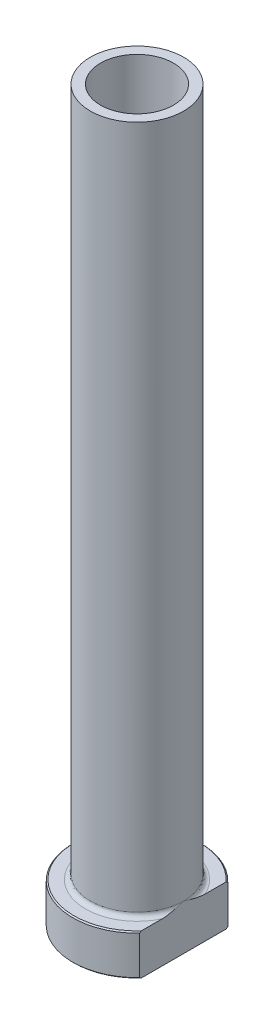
ISO-10303-21;
HEADER;
FILE_DESCRIPTION(('STEP AP214'),'2;1');
FILE_NAME('part.step','',(''),(''),'','','');
FILE_SCHEMA(('AUTOMOTIVE_DESIGN { 1 0 10303 214 1 1 1 1 }'));
ENDSEC;
DATA;
#1=APPLICATION_CONTEXT('core data for automotive mechanical design processes');
#2=APPLICATION_PROTOCOL_DEFINITION('international standard','automotive_design',2000,#1);
#3=PRODUCT_CONTEXT('',#1,'mechanical');
#4=PRODUCT('Part','Part','',(#3));
#5=PRODUCT_RELATED_PRODUCT_CATEGORY('part','',(#4));
#6=PRODUCT_DEFINITION_FORMATION('','',#4);
#7=PRODUCT_DEFINITION_CONTEXT('part definition',#1,'design');
#8=PRODUCT_DEFINITION('design','',#6,#7);
#9=PRODUCT_DEFINITION_SHAPE('','',#8);
#10=(LENGTH_UNIT() NAMED_UNIT(*) SI_UNIT(.MILLI.,.METRE.));
#11=(NAMED_UNIT(*) PLANE_ANGLE_UNIT() SI_UNIT($,.RADIAN.));
#12=(NAMED_UNIT(*) SI_UNIT($,.STERADIAN.) SOLID_ANGLE_UNIT());
#13=UNCERTAINTY_MEASURE_WITH_UNIT(LENGTH_MEASURE(1.E-05),#10,'distance_accuracy_value','');
#14=(GEOMETRIC_REPRESENTATION_CONTEXT(3) GLOBAL_UNCERTAINTY_ASSIGNED_CONTEXT((#13)) GLOBAL_UNIT_ASSIGNED_CONTEXT((#10,
#11,#12)) REPRESENTATION_CONTEXT('',''));
#15=CARTESIAN_POINT('',(0.,0.,0.));
#16=DIRECTION('',(0.,0.,1.));
#17=DIRECTION('',(1.,0.,0.));
#18=AXIS2_PLACEMENT_3D('',#15,#16,#17);
#19=CARTESIAN_POINT('',(0.,92.1876809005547,0.));
#20=DIRECTION('',(0.,1.,0.));
#21=DIRECTION('',(0.,0.,1.));
#22=AXIS2_PLACEMENT_3D('',#19,#20,#21);
#23=CYLINDRICAL_SURFACE('',#22,6.24999999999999);
#24=CARTESIAN_POINT('',(0.,125.,0.));
#25=DIRECTION('',(0.,1.,0.));
#26=DIRECTION('',(0.,0.,1.));
#27=AXIS2_PLACEMENT_3D('',#24,#25,#26);
#28=CIRCLE('',#27,6.24999999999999);
#29=CARTESIAN_POINT('',(0.,125.,6.24999999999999));
#30=VERTEX_POINT('',#29);
#31=EDGE_CURVE('E167',#30,#30,#28,.T.);
#32=ORIENTED_EDGE('',*,*,#31,.T.);
#33=EDGE_LOOP('',(#32));
#34=FACE_BOUND('',#33,.T.);
#35=CARTESIAN_POINT('',(0.,70.,0.));
#36=DIRECTION('',(0.,1.,0.));
#37=DIRECTION('',(0.,0.,1.));
#38=AXIS2_PLACEMENT_3D('',#35,#36,#37);
#39=CIRCLE('',#38,6.24999999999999);
#40=CARTESIAN_POINT('',(0.,70.,6.24999999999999));
#41=VERTEX_POINT('',#40);
#42=EDGE_CURVE('E170',#41,#41,#39,.T.);
#43=ORIENTED_EDGE('',*,*,#42,.F.);
#44=EDGE_LOOP('',(#43));
#45=FACE_BOUND('',#44,.T.);
#46=ADVANCED_FACE('F32',(#34,#45),#23,.F.);
#47=CARTESIAN_POINT('',(-6.24999999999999,125.,0.));
#48=DIRECTION('',(0.,1.,0.));
#49=DIRECTION('',(0.,0.,1.));
#50=AXIS2_PLACEMENT_3D('',#47,#48,#49);
#51=PLANE('',#50);
#52=CARTESIAN_POINT('',(0.,125.,0.));
#53=DIRECTION('',(0.,1.,0.));
#54=DIRECTION('',(0.,0.,1.));
#55=AXIS2_PLACEMENT_3D('',#52,#53,#54);
#56=CIRCLE('',#55,8.);
#57=CARTESIAN_POINT('',(0.,125.,8.));
#58=VERTEX_POINT('',#57);
#59=EDGE_CURVE('E174',#58,#58,#56,.T.);
#60=ORIENTED_EDGE('',*,*,#59,.T.);
#61=EDGE_LOOP('',(#60));
#62=FACE_BOUND('',#61,.T.);
#63=ORIENTED_EDGE('',*,*,#31,.F.);
#64=EDGE_LOOP('',(#63));
#65=FACE_BOUND('',#64,.T.);
#66=ADVANCED_FACE('F157',(#62,#65),#51,.T.);
#67=CARTESIAN_POINT('',(0.,92.1876809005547,0.));
#68=DIRECTION('',(0.,1.,0.));
#69=DIRECTION('',(0.,0.,1.));
#70=AXIS2_PLACEMENT_3D('',#67,#68,#69);
#71=CYLINDRICAL_SURFACE('',#70,8.);
#72=CARTESIAN_POINT('',(0.,7.8,0.));
#73=DIRECTION('',(0.,1.,0.));
#74=DIRECTION('',(0.,0.,1.));
#75=AXIS2_PLACEMENT_3D('',#72,#73,#74);
#76=CIRCLE('',#75,8.);
#77=CARTESIAN_POINT('',(8.,7.8,0.));
#78=VERTEX_POINT('',#77);
#79=EDGE_CURVE('E180',#78,#78,#76,.T.);
#80=ORIENTED_EDGE('',*,*,#79,.T.);
#81=EDGE_LOOP('',(#80));
#82=FACE_BOUND('',#81,.T.);
#83=ORIENTED_EDGE('',*,*,#59,.F.);
#84=EDGE_LOOP('',(#83));
#85=FACE_BOUND('',#84,.T.);
#86=ADVANCED_FACE('F162',(#82,#85),#71,.T.);
#87=CARTESIAN_POINT('',(-7.99999999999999,7.,0.));
#88=DIRECTION('',(0.,1.,0.));
#89=DIRECTION('',(0.,0.,1.));
#90=AXIS2_PLACEMENT_3D('',#87,#88,#89);
#91=PLANE('',#90);
#92=DIRECTION('',(0.,0.,1.));
#93=VECTOR('',#92,1.);
#94=CARTESIAN_POINT('',(8.,7.,0.));
#95=LINE('',#94,#93);
#96=CARTESIAN_POINT('',(8.,7.,-7.25534285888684));
#97=VERTEX_POINT('',#96);
#98=CARTESIAN_POINT('',(8.,7.,-3.66606055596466));
#99=VERTEX_POINT('',#98);
#100=EDGE_CURVE('E54',#97,#99,#95,.T.);
#101=ORIENTED_EDGE('',*,*,#100,.F.);
#102=CARTESIAN_POINT('',(0.,7.,0.));
#103=DIRECTION('',(0.,1.,0.));
#104=DIRECTION('',(0.,0.,1.));
#105=AXIS2_PLACEMENT_3D('',#102,#103,#104);
#106=CIRCLE('',#105,10.8);
#107=CARTESIAN_POINT('',(8.,7.,7.25534285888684));
#108=VERTEX_POINT('',#107);
#109=EDGE_CURVE('E186',#97,#108,#106,.T.);
#110=ORIENTED_EDGE('',*,*,#109,.T.);
#111=CARTESIAN_POINT('',(8.,7.,3.66606055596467));
#112=VERTEX_POINT('',#111);
#113=EDGE_CURVE('E134',#112,#108,#95,.T.);
#114=ORIENTED_EDGE('',*,*,#113,.F.);
#115=CARTESIAN_POINT('',(0.,7.,0.));
#116=DIRECTION('',(0.,1.,0.));
#117=DIRECTION('',(0.,0.,1.));
#118=AXIS2_PLACEMENT_3D('',#115,#116,#117);
#119=CIRCLE('',#118,8.8);
#120=EDGE_CURVE('E183',#112,#99,#119,.F.);
#121=ORIENTED_EDGE('',*,*,#120,.T.);
#122=EDGE_LOOP('',(#101,#110,#114,#121));
#123=FACE_BOUND('',#122,.T.);
#124=ADVANCED_FACE('F197',(#123),#91,.T.);
#125=CARTESIAN_POINT('',(0.,92.1876809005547,0.));
#126=DIRECTION('',(0.,1.,0.));
#127=DIRECTION('',(0.,0.,1.));
#128=AXIS2_PLACEMENT_3D('',#125,#126,#127);
#129=CYLINDRICAL_SURFACE('',#128,11.);
#130=DIRECTION('',(0.,-1.,0.));
#131=VECTOR('',#130,1.);
#132=CARTESIAN_POINT('',(8.,125.,7.54983443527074));
#133=LINE('',#132,#131);
#134=CARTESIAN_POINT('',(8.,6.80000000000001,7.54983443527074));
#135=VERTEX_POINT('',#134);
#136=CARTESIAN_POINT('',(8.,0.200000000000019,7.54983443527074));
#137=VERTEX_POINT('',#136);
#138=EDGE_CURVE('E82',#135,#137,#133,.T.);
#139=ORIENTED_EDGE('',*,*,#138,.F.);
#140=CARTESIAN_POINT('',(0.,6.80000000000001,0.));
#141=DIRECTION('',(0.,1.,0.));
#142=DIRECTION('',(0.,0.,1.));
#143=AXIS2_PLACEMENT_3D('',#140,#141,#142);
#144=CIRCLE('',#143,11.);
#145=CARTESIAN_POINT('',(8.,6.80000000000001,-7.54983443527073));
#146=VERTEX_POINT('',#145);
#147=EDGE_CURVE('E95',#135,#146,#144,.F.);
#148=ORIENTED_EDGE('',*,*,#147,.T.);
#149=DIRECTION('',(0.,-1.,0.));
#150=VECTOR('',#149,1.);
#151=CARTESIAN_POINT('',(8.,125.,-7.54983443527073));
#152=LINE('',#151,#150);
#153=CARTESIAN_POINT('',(8.,0.20000000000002,-7.54983443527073));
#154=VERTEX_POINT('',#153);
#155=EDGE_CURVE('E192',#146,#154,#152,.T.);
#156=ORIENTED_EDGE('',*,*,#155,.T.);
#157=CARTESIAN_POINT('',(0.,0.20000000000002,0.));
#158=DIRECTION('',(0.,-1.,0.));
#159=DIRECTION('',(0.,0.,-1.));
#160=AXIS2_PLACEMENT_3D('',#157,#158,#159);
#161=CIRCLE('',#160,11.);
#162=EDGE_CURVE('E98',#154,#137,#161,.F.);
#163=ORIENTED_EDGE('',*,*,#162,.T.);
#164=EDGE_LOOP('',(#139,#148,#156,#163));
#165=FACE_BOUND('',#164,.T.);
#166=ADVANCED_FACE('F190',(#165),#129,.T.);
#167=CARTESIAN_POINT('',(-11.,0.,0.));
#168=DIRECTION('',(0.,-1.,0.));
#169=DIRECTION('',(0.,0.,-1.));
#170=AXIS2_PLACEMENT_3D('',#167,#168,#169);
#171=PLANE('',#170);
#172=CARTESIAN_POINT('',(0.,0.,0.));
#173=DIRECTION('',(0.,-1.,0.));
#174=DIRECTION('',(0.,0.,-1.));
#175=AXIS2_PLACEMENT_3D('',#172,#173,#174);
#176=CIRCLE('',#175,6.99999999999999);
#177=CARTESIAN_POINT('',(0.,0.,-6.99999999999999));
#178=VERTEX_POINT('',#177);
#179=EDGE_CURVE('E40',#178,#178,#176,.F.);
#180=ORIENTED_EDGE('',*,*,#179,.T.);
#181=EDGE_LOOP('',(#180));
#182=FACE_BOUND('',#181,.T.);
#183=DIRECTION('',(0.,0.,-1.));
#184=VECTOR('',#183,1.);
#185=CARTESIAN_POINT('',(8.,0.,7.54983443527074));
#186=LINE('',#185,#184);
#187=CARTESIAN_POINT('',(8.,0.,7.25534285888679));
#188=VERTEX_POINT('',#187);
#189=CARTESIAN_POINT('',(8.,0.,-7.25534285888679));
#190=VERTEX_POINT('',#189);
#191=EDGE_CURVE('E47',#188,#190,#186,.T.);
#192=ORIENTED_EDGE('',*,*,#191,.F.);
#193=CARTESIAN_POINT('',(0.,0.,0.));
#194=DIRECTION('',(0.,-1.,0.));
#195=DIRECTION('',(0.,0.,-1.));
#196=AXIS2_PLACEMENT_3D('',#193,#194,#195);
#197=CIRCLE('',#196,10.8);
#198=EDGE_CURVE('E92',#188,#190,#197,.T.);
#199=ORIENTED_EDGE('',*,*,#198,.T.);
#200=EDGE_LOOP('',(#192,#199));
#201=FACE_BOUND('',#200,.T.);
#202=ADVANCED_FACE('F91',(#182,#201),#171,.T.);
#203=CARTESIAN_POINT('',(0.,92.1876809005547,0.));
#204=DIRECTION('',(0.,1.,0.));
#205=DIRECTION('',(0.,0.,1.));
#206=AXIS2_PLACEMENT_3D('',#203,#204,#205);
#207=CYLINDRICAL_SURFACE('',#206,6.49999999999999);
#208=CARTESIAN_POINT('',(0.,0.5,0.));
#209=DIRECTION('',(0.,-1.,0.));
#210=DIRECTION('',(0.,0.,-1.));
#211=AXIS2_PLACEMENT_3D('',#208,#209,#210);
#212=CIRCLE('',#211,6.49999999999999);
#213=CARTESIAN_POINT('',(0.,0.5,-6.49999999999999));
#214=VERTEX_POINT('',#213);
#215=EDGE_CURVE('E11',#214,#214,#212,.T.);
#216=ORIENTED_EDGE('',*,*,#215,.T.);
#217=EDGE_LOOP('',(#216));
#218=FACE_BOUND('',#217,.T.);
#219=CARTESIAN_POINT('',(0.,58.,0.));
#220=DIRECTION('',(0.,1.,0.));
#221=DIRECTION('',(0.,0.,1.));
#222=AXIS2_PLACEMENT_3D('',#219,#220,#221);
#223=CIRCLE('',#222,6.5);
#224=CARTESIAN_POINT('',(0.,58.,6.5));
#225=VERTEX_POINT('',#224);
#226=EDGE_CURVE('E172',#225,#225,#223,.T.);
#227=ORIENTED_EDGE('',*,*,#226,.T.);
#228=EDGE_LOOP('',(#227));
#229=FACE_BOUND('',#228,.T.);
#230=ADVANCED_FACE('F215',(#218,#229),#207,.F.);
#231=CARTESIAN_POINT('',(0.,58.,0.));
#232=DIRECTION('',(0.,-1.,0.));
#233=DIRECTION('',(0.,0.,-1.));
#234=AXIS2_PLACEMENT_3D('',#231,#232,#233);
#235=CONICAL_SURFACE('',#234,6.5,0.0208303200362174);
#236=ORIENTED_EDGE('',*,*,#42,.T.);
#237=EDGE_LOOP('',(#236));
#238=FACE_BOUND('',#237,.T.);
#239=ORIENTED_EDGE('',*,*,#226,.F.);
#240=EDGE_LOOP('',(#239));
#241=FACE_BOUND('',#240,.T.);
#242=ADVANCED_FACE('F111',(#238,#241),#235,.F.);
#243=CARTESIAN_POINT('',(0.,7.8,0.));
#244=DIRECTION('',(0.,1.,0.));
#245=DIRECTION('',(0.,0.,1.));
#246=AXIS2_PLACEMENT_3D('',#243,#244,#245);
#247=TOROIDAL_SURFACE('',#246,8.8,0.8);
#248=ORIENTED_EDGE('',*,*,#120,.F.);
#249=CARTESIAN_POINT('',(8.,7.8,0.));
#250=CARTESIAN_POINT('',(8.,7.80000101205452,-1.0962450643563E-10));
#251=CARTESIAN_POINT('',(8.,7.80000202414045,2.93324062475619E-07));
#252=CARTESIAN_POINT('',(8.,7.80000394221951,1.16283082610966E-06));
#253=CARTESIAN_POINT('',(8.,7.80000483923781,1.75365125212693E-06));
#254=CARTESIAN_POINT('',(8.,7.80000665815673,3.16446761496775E-06));
#255=CARTESIAN_POINT('',(8.,7.80000756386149,4.0054914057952E-06));
#256=CARTESIAN_POINT('',(8.,7.80000923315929,5.7834789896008E-06));
#257=CARTESIAN_POINT('',(8.,7.80000999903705,6.71842007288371E-06));
#258=CARTESIAN_POINT('',(8.,7.80001270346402,1.02037212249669E-05));
#259=CARTESIAN_POINT('',(8.,7.80001449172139,1.28740396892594E-05));
#260=CARTESIAN_POINT('',(8.,7.80001755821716,1.82727380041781E-05));
#261=CARTESIAN_POINT('',(8.,7.8000188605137,2.0988155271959E-05));
#262=CARTESIAN_POINT('',(8.,7.80002405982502,3.20647795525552E-05));
#263=CARTESIAN_POINT('',(8.,7.80002777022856,4.05225573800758E-05));
#264=CARTESIAN_POINT('',(8.,7.80003348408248,5.68037688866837E-05));
#265=CARTESIAN_POINT('',(8.,7.80003564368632,6.45728858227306E-05));
#266=CARTESIAN_POINT('',(8.,7.8000509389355,0.000121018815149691));
#267=CARTESIAN_POINT('',(8.,7.80006211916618,0.000170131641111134));
#268=CARTESIAN_POINT('',(7.99999999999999,7.80011100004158,0.000362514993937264));
#269=CARTESIAN_POINT('',(8.,7.80015802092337,0.000503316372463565));
#270=CARTESIAN_POINT('',(8.00000000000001,7.80033939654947,0.00105711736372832));
#271=CARTESIAN_POINT('',(8.,7.80046737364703,0.0014716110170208));
#272=CARTESIAN_POINT('',(7.99999999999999,7.80097644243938,0.00310648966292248));
#273=CARTESIAN_POINT('',(7.99999999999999,7.80136531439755,0.00432501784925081));
#274=CARTESIAN_POINT('',(8.00000000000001,7.80297358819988,0.00937955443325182));
#275=CARTESIAN_POINT('',(8.,7.80418342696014,0.01321784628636));
#276=CARTESIAN_POINT('',(7.99999999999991,7.82754122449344,0.0873020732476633));
#277=CARTESIAN_POINT('',(7.99999999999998,7.84979021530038,0.157524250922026));
#278=CARTESIAN_POINT('',(8.00000000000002,7.89322681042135,0.295235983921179));
#279=CARTESIAN_POINT('',(8.,7.91442151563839,0.362723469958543));
#280=CARTESIAN_POINT('',(7.99999999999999,7.95923432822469,0.506178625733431));
#281=CARTESIAN_POINT('',(8.,7.9828252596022,0.582154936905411));
#282=CARTESIAN_POINT('',(8.,8.02983069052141,0.735069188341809));
#283=CARTESIAN_POINT('',(8.,8.05324046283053,0.812008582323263));
#284=CARTESIAN_POINT('',(8.,8.09303795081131,0.944645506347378));
#285=CARTESIAN_POINT('',(8.,8.10956807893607,1.00030022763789));
#286=CARTESIAN_POINT('',(8.,8.14221289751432,1.11157683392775));
#287=CARTESIAN_POINT('',(8.,8.15832854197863,1.16719843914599));
#288=CARTESIAN_POINT('',(8.,8.20527739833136,1.3316405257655));
#289=CARTESIAN_POINT('',(8.,8.23549814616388,1.4406371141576));
#290=CARTESIAN_POINT('',(8.,8.29826335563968,1.6760683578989));
#291=CARTESIAN_POINT('',(8.,8.33044741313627,1.80259995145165));
#292=CARTESIAN_POINT('',(8.,8.39126396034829,2.05750030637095));
#293=CARTESIAN_POINT('',(8.,8.41986879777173,2.18587573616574));
#294=CARTESIAN_POINT('',(8.,8.47414203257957,2.45321874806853));
#295=CARTESIAN_POINT('',(8.,8.49943375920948,2.59226394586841));
#296=CARTESIAN_POINT('',(8.,8.54278750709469,2.87150561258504));
#297=CARTESIAN_POINT('',(8.,8.5608502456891,3.01170196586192));
#298=CARTESIAN_POINT('',(8.,8.58291287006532,3.24319459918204));
#299=CARTESIAN_POINT('',(8.,8.589627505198,3.33423069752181));
#300=CARTESIAN_POINT('',(8.,8.59844042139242,3.51651109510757));
#301=CARTESIAN_POINT('',(8.,8.60054027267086,3.60775531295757));
#302=CARTESIAN_POINT('',(8.,8.59923478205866,3.78855451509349));
#303=CARTESIAN_POINT('',(8.,8.59592927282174,3.87810991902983));
#304=CARTESIAN_POINT('',(8.,8.5828878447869,4.05671727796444));
#305=CARTESIAN_POINT('',(8.,8.57315718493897,4.14576958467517));
#306=CARTESIAN_POINT('',(8.,8.54786053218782,4.3091004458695));
#307=CARTESIAN_POINT('',(8.,8.53341905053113,4.38354919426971));
#308=CARTESIAN_POINT('',(8.,8.49747543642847,4.53120906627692));
#309=CARTESIAN_POINT('',(8.,8.47593618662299,4.60441150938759));
#310=CARTESIAN_POINT('',(8.,8.42376924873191,4.74853436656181));
#311=CARTESIAN_POINT('',(8.,8.39303920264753,4.81941853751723));
#312=CARTESIAN_POINT('',(8.,8.32008168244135,4.95490582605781));
#313=CARTESIAN_POINT('',(8.,8.27792970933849,5.0195465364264));
#314=CARTESIAN_POINT('',(8.,8.20692535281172,5.10354772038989));
#315=CARTESIAN_POINT('',(8.,8.18397837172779,5.12788591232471));
#316=CARTESIAN_POINT('',(8.,8.13503511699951,5.17336988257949));
#317=CARTESIAN_POINT('',(8.,8.10903727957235,5.19451401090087));
#318=CARTESIAN_POINT('',(8.,8.05362521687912,5.23266411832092));
#319=CARTESIAN_POINT('',(8.,8.02417247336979,5.24961527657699));
#320=CARTESIAN_POINT('',(8.,7.96255238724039,5.27751973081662));
#321=CARTESIAN_POINT('',(8.,7.93039220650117,5.28848831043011));
#322=CARTESIAN_POINT('',(8.,7.87282733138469,5.30129051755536));
#323=CARTESIAN_POINT('',(8.,7.84777777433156,5.30473535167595));
#324=CARTESIAN_POINT('',(8.,7.79745799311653,5.30730687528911));
#325=CARTESIAN_POINT('',(8.,7.77218785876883,5.30643524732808));
#326=CARTESIAN_POINT('',(8.,7.72220872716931,5.30045124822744));
#327=CARTESIAN_POINT('',(8.,7.69749884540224,5.29534612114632));
#328=CARTESIAN_POINT('',(8.,7.64919855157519,5.2813062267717));
#329=CARTESIAN_POINT('',(8.,7.62560888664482,5.27236894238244));
#330=CARTESIAN_POINT('',(8.,7.57186978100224,5.24749103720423));
#331=CARTESIAN_POINT('',(8.,7.54235117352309,5.23019143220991));
#332=CARTESIAN_POINT('',(8.,7.48647501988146,5.1910787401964));
#333=CARTESIAN_POINT('',(8.,7.46012476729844,5.16925554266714));
#334=CARTESIAN_POINT('',(8.,7.39758131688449,5.11005232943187));
#335=CARTESIAN_POINT('',(8.,7.36345256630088,5.07050732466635));
#336=CARTESIAN_POINT('',(8.,7.30158414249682,4.98680536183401));
#337=CARTESIAN_POINT('',(8.,7.27385227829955,4.94264286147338));
#338=CARTESIAN_POINT('',(8.,7.22655631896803,4.85651446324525));
#339=CARTESIAN_POINT('',(8.,7.20642608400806,4.81485346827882));
#340=CARTESIAN_POINT('',(8.,7.16979237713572,4.7299501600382));
#341=CARTESIAN_POINT('',(8.,7.15329194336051,4.68670655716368));
#342=CARTESIAN_POINT('',(8.,7.1082475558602,4.55471342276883));
#343=CARTESIAN_POINT('',(8.,7.0844820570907,4.46433285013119));
#344=CARTESIAN_POINT('',(8.,7.04606817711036,4.27884520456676));
#345=CARTESIAN_POINT('',(8.,7.03172934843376,4.18367881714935));
#346=CARTESIAN_POINT('',(8.,7.01115182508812,3.99231790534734));
#347=CARTESIAN_POINT('',(8.,7.00492963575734,3.89612168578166));
#348=CARTESIAN_POINT('',(8.,6.99917472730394,3.70683203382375));
#349=CARTESIAN_POINT('',(8.,6.99942213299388,3.6137441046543));
#350=CARTESIAN_POINT('',(8.,7.0050033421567,3.42814181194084));
#351=CARTESIAN_POINT('',(8.,7.0103150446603,3.33562671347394));
#352=CARTESIAN_POINT('',(8.,7.02729273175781,3.12465235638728));
#353=CARTESIAN_POINT('',(8.,7.04033732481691,3.00630616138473));
#354=CARTESIAN_POINT('',(8.,7.0720601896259,2.77043320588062));
#355=CARTESIAN_POINT('',(8.,7.09073668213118,2.65290619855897));
#356=CARTESIAN_POINT('',(8.,7.13314336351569,2.41598317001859));
#357=CARTESIAN_POINT('',(8.,7.15698005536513,2.29660645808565));
#358=CARTESIAN_POINT('',(8.,7.20856500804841,2.05839418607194));
#359=CARTESIAN_POINT('',(8.,7.23632304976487,1.93956077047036));
#360=CARTESIAN_POINT('',(8.,7.30538420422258,1.66026758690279));
#361=CARTESIAN_POINT('',(8.,7.34797978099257,1.50012949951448));
#362=CARTESIAN_POINT('',(8.,7.43661699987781,1.18271330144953));
#363=CARTESIAN_POINT('',(8.,7.48261587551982,1.02542306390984));
#364=CARTESIAN_POINT('',(8.,7.55073856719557,0.798945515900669));
#365=CARTESIAN_POINT('',(8.,7.57189590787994,0.729464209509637));
#366=CARTESIAN_POINT('',(8.,7.61466169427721,0.590318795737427));
#367=CARTESIAN_POINT('',(8.,7.63627166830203,0.520655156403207));
#368=CARTESIAN_POINT('',(8.,7.68075896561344,0.378072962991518));
#369=CARTESIAN_POINT('',(8.,7.70364749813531,0.305157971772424));
#370=CARTESIAN_POINT('',(8.,7.74926260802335,0.160522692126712));
#371=CARTESIAN_POINT('',(8.,7.77198614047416,0.0888015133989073));
#372=CARTESIAN_POINT('',(8.,7.79581756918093,0.0132146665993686));
#373=CARTESIAN_POINT('',(8.,7.79702841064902,0.00937319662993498));
#374=CARTESIAN_POINT('',(8.,7.79863692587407,0.00431792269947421));
#375=CARTESIAN_POINT('',(8.,7.79902501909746,0.00310183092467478));
#376=CARTESIAN_POINT('',(8.,7.79953313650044,0.00147000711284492));
#377=CARTESIAN_POINT('',(8.,7.79966092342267,0.00105612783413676));
#378=CARTESIAN_POINT('',(8.,7.79984206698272,0.000503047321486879));
#379=CARTESIAN_POINT('',(8.,7.79988905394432,0.000362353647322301));
#380=CARTESIAN_POINT('',(8.,7.79993790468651,0.000170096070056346));
#381=CARTESIAN_POINT('',(8.,7.79994908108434,0.000120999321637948));
#382=CARTESIAN_POINT('',(8.,7.79996436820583,6.45695787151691E-05));
#383=CARTESIAN_POINT('',(8.,7.79996652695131,5.68014455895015E-05));
#384=CARTESIAN_POINT('',(8.,7.79997223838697,4.05221683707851E-05));
#385=CARTESIAN_POINT('',(8.,7.79997594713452,3.20652909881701E-05));
#386=CARTESIAN_POINT('',(8.,7.7999811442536,2.09895693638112E-05));
#387=CARTESIAN_POINT('',(8.,7.79998244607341,1.8274225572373E-05));
#388=CARTESIAN_POINT('',(8.,7.79998551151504,1.28755880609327E-05));
#389=CARTESIAN_POINT('',(8.,7.79998729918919,1.02052494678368E-05));
#390=CARTESIAN_POINT('',(8.,7.79999000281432,6.71981830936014E-06));
#391=CARTESIAN_POINT('',(8.,7.79999076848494,5.78481760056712E-06));
#392=CARTESIAN_POINT('',(8.,7.79999243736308,4.00667344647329E-06));
#393=CARTESIAN_POINT('',(8.,7.79999334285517,3.16555188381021E-06));
#394=CARTESIAN_POINT('',(8.,7.79999516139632,1.75450207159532E-06));
#395=CARTESIAN_POINT('',(8.,7.79999605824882,1.16355293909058E-06));
#396=CARTESIAN_POINT('',(8.,7.799997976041,2.93728150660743E-07));
#397=CARTESIAN_POINT('',(8.,7.79999898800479,1.0962175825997E-10));
#398=CARTESIAN_POINT('',(8.,7.8,0.));
#399=B_SPLINE_CURVE_WITH_KNOTS('',3,(#249,#250,#251,#252,#253,#254,#255,#256,#257,#258,#259,
#260,#261,#262,#263,#264,#265,#266,#267,#268,#269,#270,#271,#272,#273,#274,#275,#276,#277,#278,
#279,#280,#281,#282,#283,#284,#285,#286,#287,#288,#289,#290,#291,#292,#293,#294,#295,#296,#297,
#298,#299,#300,#301,#302,#303,#304,#305,#306,#307,#308,#309,#310,#311,#312,#313,#314,#315,#316,
#317,#318,#319,#320,#321,#322,#323,#324,#325,#326,#327,#328,#329,#330,#331,#332,#333,#334,#335,
#336,#337,#338,#339,#340,#341,#342,#343,#344,#345,#346,#347,#348,#349,#350,#351,#352,#353,#354,
#355,#356,#357,#358,#359,#360,#361,#362,#363,#364,#365,#366,#367,#368,#369,#370,#371,#372,#373,
#374,#375,#376,#377,#378,#379,#380,#381,#382,#383,#384,#385,#386,#387,#388,#389,#390,#391,#392,
#393,#394,#395,#396,#397,#398),.UNSPECIFIED.,.T.,.F.,(4,2,2,2,2,2,2,2,2,2,2,2,2,2,2,2,2,2,2,2,2,
2,2,2,2,2,2,2,2,2,2,2,2,2,2,2,2,2,2,2,2,2,2,2,2,2,2,2,2,2,2,2,2,2,2,2,2,2,2,2,2,2,2,2,2,2,2,2,2,
2,2,2,2,2,4),(0.,3.04287652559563E-06,6.25420338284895E-06,9.94386729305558E-06,
1.35664370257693E-05,2.31665076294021E-05,3.21939875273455E-05,5.9835345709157E-05,
8.39944758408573E-05,0.000235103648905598,0.000679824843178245,0.0019818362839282,
0.00581831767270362,0.0178924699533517,0.238870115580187,0.451084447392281,0.689746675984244,
0.931010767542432,1.10518257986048,1.27890913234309,1.61821807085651,2.00985537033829,
2.4043526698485,2.82819297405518,3.25199120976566,3.52574836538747,3.79941235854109,
4.06807884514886,4.33652570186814,4.56378083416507,4.79224376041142,5.02335234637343,
5.2529690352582,5.35309534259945,5.45327319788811,5.55469877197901,5.65586400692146,
5.73137360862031,5.80685377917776,5.88220505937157,5.95760590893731,6.05967508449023,
6.16197489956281,6.31780492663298,6.4738241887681,6.61243130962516,6.75115400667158,
7.03070266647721,7.31902502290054,7.60793277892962,7.88703491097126,8.16492456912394,
8.52193605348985,8.87883486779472,9.24395493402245,9.61000233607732,10.1070420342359,
10.5986476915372,10.816540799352,11.0353545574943,11.264626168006,11.4903206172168,
11.5024047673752,11.506233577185,11.5075336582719,11.5079780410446,11.5081291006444,
11.5081532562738,11.5081808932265,11.5081899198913,11.5081995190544,11.5082031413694,
11.5082068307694,11.5082100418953,11.5082130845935),.UNSPECIFIED.);
#400=EDGE_CURVE('E126',#112,#78,#399,.T.);
#401=ORIENTED_EDGE('',*,*,#400,.T.);
#402=ORIENTED_EDGE('',*,*,#79,.F.);
#403=CARTESIAN_POINT('',(8.,7.8,0.));
#404=CARTESIAN_POINT('',(8.,7.79999898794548,1.09628441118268E-10));
#405=CARTESIAN_POINT('',(8.,7.79999797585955,-2.93324058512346E-07));
#406=CARTESIAN_POINT('',(8.,7.79999605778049,-1.16283082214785E-06));
#407=CARTESIAN_POINT('',(8.,7.79999516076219,-1.75365124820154E-06));
#408=CARTESIAN_POINT('',(8.,7.79999334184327,-3.1644676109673E-06));
#409=CARTESIAN_POINT('',(8.,7.79999243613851,-4.00549140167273E-06));
#410=CARTESIAN_POINT('',(8.,7.79999076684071,-5.78347898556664E-06));
#411=CARTESIAN_POINT('',(8.,7.79999000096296,-6.7184200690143E-06));
#412=CARTESIAN_POINT('',(8.,7.79998729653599,-1.02037212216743E-05));
#413=CARTESIAN_POINT('',(8.,7.79998550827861,-1.28740396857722E-05));
#414=CARTESIAN_POINT('',(8.,7.79998244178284,-1.82727380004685E-05));
#415=CARTESIAN_POINT('',(8.,7.7999811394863,-2.09881552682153E-05));
#416=CARTESIAN_POINT('',(8.,7.79997594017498,-3.20647795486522E-05));
#417=CARTESIAN_POINT('',(8.,7.79997222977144,-4.05225573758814E-05));
#418=CARTESIAN_POINT('',(8.,7.79996651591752,-5.68037688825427E-05));
#419=CARTESIAN_POINT('',(8.,7.79996435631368,-6.45728858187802E-05));
#420=CARTESIAN_POINT('',(8.,7.79994906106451,-0.000121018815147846));
#421=CARTESIAN_POINT('',(8.,7.79993788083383,-0.000170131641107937));
#422=CARTESIAN_POINT('',(7.99999999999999,7.79988899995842,-0.000362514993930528));
#423=CARTESIAN_POINT('',(8.,7.79984197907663,-0.000503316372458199));
#424=CARTESIAN_POINT('',(8.00000000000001,7.79966060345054,-0.00105711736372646));
#425=CARTESIAN_POINT('',(8.,7.79953262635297,-0.00147161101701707));
#426=CARTESIAN_POINT('',(7.99999999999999,7.79902355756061,-0.0031064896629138));
#427=CARTESIAN_POINT('',(7.99999999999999,7.79863468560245,-0.00432501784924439));
#428=CARTESIAN_POINT('',(8.00000000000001,7.79702641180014,-0.00937955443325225));
#429=CARTESIAN_POINT('',(8.,7.79581657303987,-0.0132178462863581));
#430=CARTESIAN_POINT('',(7.99999999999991,7.77245877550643,-0.0873020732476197));
#431=CARTESIAN_POINT('',(7.99999999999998,7.75020978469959,-0.157524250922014));
#432=CARTESIAN_POINT('',(8.00000000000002,7.70677318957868,-0.295235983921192));
#433=CARTESIAN_POINT('',(8.,7.68557848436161,-0.362723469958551));
#434=CARTESIAN_POINT('',(7.99999999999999,7.64076567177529,-0.506178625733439));
#435=CARTESIAN_POINT('',(8.,7.61717474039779,-0.582154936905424));
#436=CARTESIAN_POINT('',(8.,7.57016930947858,-0.735069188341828));
#437=CARTESIAN_POINT('',(8.,7.54675953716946,-0.812008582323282));
#438=CARTESIAN_POINT('',(8.,7.50696204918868,-0.944645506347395));
#439=CARTESIAN_POINT('',(8.,7.49043192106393,-1.0003002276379));
#440=CARTESIAN_POINT('',(8.,7.45778710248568,-1.11157683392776));
#441=CARTESIAN_POINT('',(8.,7.44167145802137,-1.167198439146));
#442=CARTESIAN_POINT('',(8.,7.39472260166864,-1.3316405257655));
#443=CARTESIAN_POINT('',(8.,7.36450185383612,-1.4406371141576));
#444=CARTESIAN_POINT('',(8.,7.30173664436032,-1.67606835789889));
#445=CARTESIAN_POINT('',(8.,7.26955258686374,-1.80259995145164));
#446=CARTESIAN_POINT('',(8.,7.20873603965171,-2.05750030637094));
#447=CARTESIAN_POINT('',(8.,7.18013120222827,-2.18587573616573));
#448=CARTESIAN_POINT('',(8.,7.12585796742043,-2.45321874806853));
#449=CARTESIAN_POINT('',(8.,7.10056624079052,-2.5922639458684));
#450=CARTESIAN_POINT('',(8.,7.05721249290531,-2.87150561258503));
#451=CARTESIAN_POINT('',(8.,7.0391497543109,-3.01170196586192));
#452=CARTESIAN_POINT('',(8.,7.01708712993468,-3.24319459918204));
#453=CARTESIAN_POINT('',(8.,7.010372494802,-3.3342306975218));
#454=CARTESIAN_POINT('',(8.,7.00155957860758,-3.51651109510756));
#455=CARTESIAN_POINT('',(8.,6.99945972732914,-3.60775531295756));
#456=CARTESIAN_POINT('',(8.,7.00076521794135,-3.78855451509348));
#457=CARTESIAN_POINT('',(8.,7.00407072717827,-3.87810991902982));
#458=CARTESIAN_POINT('',(8.,7.01711215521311,-4.05671727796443));
#459=CARTESIAN_POINT('',(8.,7.02684281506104,-4.14576958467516));
#460=CARTESIAN_POINT('',(8.,7.05213946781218,-4.30910044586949));
#461=CARTESIAN_POINT('',(8.,7.06658094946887,-4.3835491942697));
#462=CARTESIAN_POINT('',(8.,7.10252456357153,-4.53120906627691));
#463=CARTESIAN_POINT('',(8.,7.12406381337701,-4.60441150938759));
#464=CARTESIAN_POINT('',(8.,7.17623075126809,-4.74853436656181));
#465=CARTESIAN_POINT('',(8.,7.20696079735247,-4.81941853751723));
#466=CARTESIAN_POINT('',(8.,7.27991831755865,-4.95490582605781));
#467=CARTESIAN_POINT('',(8.,7.32207029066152,-5.01954653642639));
#468=CARTESIAN_POINT('',(8.,7.39307464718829,-5.10354772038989));
#469=CARTESIAN_POINT('',(8.,7.41602162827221,-5.12788591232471));
#470=CARTESIAN_POINT('',(8.,7.4649648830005,-5.17336988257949));
#471=CARTESIAN_POINT('',(8.,7.49096272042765,-5.19451401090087));
#472=CARTESIAN_POINT('',(8.,7.54637478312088,-5.23266411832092));
#473=CARTESIAN_POINT('',(8.,7.57582752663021,-5.24961527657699));
#474=CARTESIAN_POINT('',(8.,7.63744761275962,-5.27751973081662));
#475=CARTESIAN_POINT('',(8.,7.66960779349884,-5.28848831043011));
#476=CARTESIAN_POINT('',(8.,7.72717266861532,-5.30129051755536));
#477=CARTESIAN_POINT('',(8.,7.75222222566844,-5.30473535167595));
#478=CARTESIAN_POINT('',(8.,7.80254200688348,-5.30730687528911));
#479=CARTESIAN_POINT('',(8.,7.82781214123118,-5.30643524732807));
#480=CARTESIAN_POINT('',(8.,7.8777912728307,-5.30045124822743));
#481=CARTESIAN_POINT('',(8.,7.90250115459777,-5.29534612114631));
#482=CARTESIAN_POINT('',(8.,7.95080144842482,-5.28130622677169));
#483=CARTESIAN_POINT('',(8.,7.97439111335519,-5.27236894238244));
#484=CARTESIAN_POINT('',(8.,8.02813021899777,-5.24749103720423));
#485=CARTESIAN_POINT('',(8.,8.05764882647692,-5.23019143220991));
#486=CARTESIAN_POINT('',(8.,8.11352498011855,-5.19107874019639));
#487=CARTESIAN_POINT('',(8.,8.13987523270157,-5.16925554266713));
#488=CARTESIAN_POINT('',(8.,8.20241868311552,-5.11005232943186));
#489=CARTESIAN_POINT('',(8.,8.23654743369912,-5.07050732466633));
#490=CARTESIAN_POINT('',(8.,8.29841585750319,-4.986805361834));
#491=CARTESIAN_POINT('',(8.,8.32614772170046,-4.94264286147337));
#492=CARTESIAN_POINT('',(8.,8.37344368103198,-4.85651446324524));
#493=CARTESIAN_POINT('',(8.,8.39357391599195,-4.81485346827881));
#494=CARTESIAN_POINT('',(8.,8.43020762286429,-4.72995016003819));
#495=CARTESIAN_POINT('',(8.,8.4467080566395,-4.68670655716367));
#496=CARTESIAN_POINT('',(8.,8.4917524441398,-4.55471342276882));
#497=CARTESIAN_POINT('',(8.,8.51551794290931,-4.46433285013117));
#498=CARTESIAN_POINT('',(8.,8.55393182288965,-4.27884520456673));
#499=CARTESIAN_POINT('',(8.,8.56827065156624,-4.18367881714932));
#500=CARTESIAN_POINT('',(8.,8.58884817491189,-3.99231790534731));
#501=CARTESIAN_POINT('',(8.,8.59507036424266,-3.89612168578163));
#502=CARTESIAN_POINT('',(8.,8.60082527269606,-3.70683203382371));
#503=CARTESIAN_POINT('',(8.,8.60057786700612,-3.61374410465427));
#504=CARTESIAN_POINT('',(8.,8.59499665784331,-3.42814181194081));
#505=CARTESIAN_POINT('',(8.,8.5896849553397,-3.33562671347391));
#506=CARTESIAN_POINT('',(8.,8.57270726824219,-3.12465235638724));
#507=CARTESIAN_POINT('',(8.,8.55966267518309,-3.0063061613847));
#508=CARTESIAN_POINT('',(8.,8.5279398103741,-2.77043320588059));
#509=CARTESIAN_POINT('',(8.,8.50926331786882,-2.65290619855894));
#510=CARTESIAN_POINT('',(8.,8.46685663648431,-2.41598317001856));
#511=CARTESIAN_POINT('',(8.,8.44301994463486,-2.29660645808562));
#512=CARTESIAN_POINT('',(8.,8.39143499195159,-2.05839418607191));
#513=CARTESIAN_POINT('',(8.,8.36367695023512,-1.93956077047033));
#514=CARTESIAN_POINT('',(8.,8.29461579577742,-1.66026758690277));
#515=CARTESIAN_POINT('',(8.,8.25202021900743,-1.50012949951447));
#516=CARTESIAN_POINT('',(8.,8.16338300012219,-1.18271330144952));
#517=CARTESIAN_POINT('',(8.,8.11738412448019,-1.02542306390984));
#518=CARTESIAN_POINT('',(8.,8.04926143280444,-0.798945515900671));
#519=CARTESIAN_POINT('',(8.,8.02810409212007,-0.729464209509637));
#520=CARTESIAN_POINT('',(8.,7.98533830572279,-0.590318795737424));
#521=CARTESIAN_POINT('',(8.,7.96372833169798,-0.520655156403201));
#522=CARTESIAN_POINT('',(8.,7.91924103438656,-0.378072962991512));
#523=CARTESIAN_POINT('',(8.,7.89635250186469,-0.30515797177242));
#524=CARTESIAN_POINT('',(8.,7.85073739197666,-0.160522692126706));
#525=CARTESIAN_POINT('',(8.,7.82801385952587,-0.0888015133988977));
#526=CARTESIAN_POINT('',(8.,7.80418243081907,-0.0132146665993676));
#527=CARTESIAN_POINT('',(8.,7.80297158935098,-0.0093731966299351));
#528=CARTESIAN_POINT('',(8.,7.80136307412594,-0.00431792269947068));
#529=CARTESIAN_POINT('',(8.,7.80097498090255,-0.00310183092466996));
#530=CARTESIAN_POINT('',(8.,7.80046686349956,-0.00147000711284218));
#531=CARTESIAN_POINT('',(8.,7.80033907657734,-0.00105612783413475));
#532=CARTESIAN_POINT('',(8.,7.80015793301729,-0.000503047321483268));
#533=CARTESIAN_POINT('',(8.,7.80011094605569,-0.000362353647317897));
#534=CARTESIAN_POINT('',(8.,7.80006209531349,-0.000170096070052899));
#535=CARTESIAN_POINT('',(8.,7.80005091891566,-0.000120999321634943));
#536=CARTESIAN_POINT('',(8.,7.80003563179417,-6.45695787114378E-05));
#537=CARTESIAN_POINT('',(8.,7.8000334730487,-5.68014455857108E-05));
#538=CARTESIAN_POINT('',(8.,7.80002776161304,-4.05221683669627E-05));
#539=CARTESIAN_POINT('',(8.,7.80002405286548,-3.20652909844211E-05));
#540=CARTESIAN_POINT('',(8.,7.8000188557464,-2.09895693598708E-05));
#541=CARTESIAN_POINT('',(8.,7.80001755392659,-1.82742255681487E-05));
#542=CARTESIAN_POINT('',(8.,7.80001448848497,-1.28755880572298E-05));
#543=CARTESIAN_POINT('',(8.,7.80001270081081,-1.02052494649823E-05));
#544=CARTESIAN_POINT('',(8.,7.80000999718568,-6.71981830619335E-06));
#545=CARTESIAN_POINT('',(8.,7.80000923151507,-5.78481759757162E-06));
#546=CARTESIAN_POINT('',(8.,7.80000756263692,-4.00667344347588E-06));
#547=CARTESIAN_POINT('',(8.,7.80000665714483,-3.1655518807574E-06));
#548=CARTESIAN_POINT('',(8.,7.80000483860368,-1.75450206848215E-06));
#549=CARTESIAN_POINT('',(8.,7.80000394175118,-1.16355293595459E-06));
#550=CARTESIAN_POINT('',(8.,7.800002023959,-2.93728147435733E-07));
#551=CARTESIAN_POINT('',(8.,7.80000101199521,-1.09618340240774E-10));
#552=CARTESIAN_POINT('',(8.,7.8,0.));
#553=B_SPLINE_CURVE_WITH_KNOTS('',3,(#403,#404,#405,#406,#407,#408,#409,#410,#411,#412,#413,
#414,#415,#416,#417,#418,#419,#420,#421,#422,#423,#424,#425,#426,#427,#428,#429,#430,#431,#432,
#433,#434,#435,#436,#437,#438,#439,#440,#441,#442,#443,#444,#445,#446,#447,#448,#449,#450,#451,
#452,#453,#454,#455,#456,#457,#458,#459,#460,#461,#462,#463,#464,#465,#466,#467,#468,#469,#470,
#471,#472,#473,#474,#475,#476,#477,#478,#479,#480,#481,#482,#483,#484,#485,#486,#487,#488,#489,
#490,#491,#492,#493,#494,#495,#496,#497,#498,#499,#500,#501,#502,#503,#504,#505,#506,#507,#508,
#509,#510,#511,#512,#513,#514,#515,#516,#517,#518,#519,#520,#521,#522,#523,#524,#525,#526,#527,
#528,#529,#530,#531,#532,#533,#534,#535,#536,#537,#538,#539,#540,#541,#542,#543,#544,#545,#546,
#547,#548,#549,#550,#551,#552),.UNSPECIFIED.,.T.,.F.,(4,2,2,2,2,2,2,2,2,2,2,2,2,2,2,2,2,2,2,2,2,
2,2,2,2,2,2,2,2,2,2,2,2,2,2,2,2,2,2,2,2,2,2,2,2,2,2,2,2,2,2,2,2,2,2,2,2,2,2,2,2,2,2,2,2,2,2,2,2,
2,2,2,2,2,4),(0.,3.04287652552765E-06,6.25420338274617E-06,9.94386729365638E-06,
1.35664370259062E-05,2.31665076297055E-05,3.21939875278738E-05,5.98353457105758E-05,
8.39944758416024E-05,0.000235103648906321,0.000679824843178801,0.00198183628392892,
0.00581831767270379,0.0178924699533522,0.238870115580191,0.451084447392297,0.689746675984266,
0.931010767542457,1.10518257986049,1.2789091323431,1.61821807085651,2.00985537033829,
2.40435266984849,2.82819297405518,3.25199120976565,3.52574836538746,3.79941235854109,
4.06807884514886,4.33652570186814,4.56378083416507,4.79224376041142,5.02335234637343,
5.2529690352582,5.35309534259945,5.45327319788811,5.55469877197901,5.65586400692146,
5.73137360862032,5.80685377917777,5.88220505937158,5.95760590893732,6.05967508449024,
6.16197489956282,6.31780492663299,6.47382418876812,6.61243130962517,6.75115400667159,
7.03070266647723,7.31902502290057,7.60793277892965,7.88703491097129,8.16492456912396,
8.52193605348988,8.87883486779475,9.24395493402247,9.61000233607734,10.1070420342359,
10.5986476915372,10.816540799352,11.0353545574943,11.264626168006,11.4903206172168,
11.5024047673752,11.506233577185,11.5075336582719,11.5079780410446,11.5081291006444,
11.5081532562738,11.5081808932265,11.5081899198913,11.5081995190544,11.5082031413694,
11.5082068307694,11.5082100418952,11.5082130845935),.UNSPECIFIED.);
#554=EDGE_CURVE('E135',#78,#99,#553,.T.);
#555=ORIENTED_EDGE('',*,*,#554,.T.);
#556=EDGE_LOOP('',(#248,#401,#402,#555));
#557=FACE_BOUND('',#556,.T.);
#558=ADVANCED_FACE('F141',(#557),#247,.F.);
#559=CARTESIAN_POINT('',(0.,7.00000000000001,0.));
#560=DIRECTION('',(0.,-1.,0.));
#561=DIRECTION('',(0.,0.,-1.));
#562=AXIS2_PLACEMENT_3D('',#559,#560,#561);
#563=CONICAL_SURFACE('',#562,10.8,0.785398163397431);
#564=CARTESIAN_POINT('',(8.,-0.636730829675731,-16.6106304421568));
#565=CARTESIAN_POINT('',(8.,-0.418611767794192,-16.3685283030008));
#566=CARTESIAN_POINT('',(8.,-0.200984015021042,-16.1259843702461));
#567=CARTESIAN_POINT('',(8.,0.233148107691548,-15.6398927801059));
#568=CARTESIAN_POINT('',(8.,0.449652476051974,-15.3963451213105));
#569=CARTESIAN_POINT('',(8.,1.09739989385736,-14.6638687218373));
#570=CARTESIAN_POINT('',(8.,1.52674426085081,-14.1732538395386));
#571=CARTESIAN_POINT('',(8.,2.167928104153,-13.4304656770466));
#572=CARTESIAN_POINT('',(8.,2.38226067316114,-13.1804430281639));
#573=CARTESIAN_POINT('',(8.,2.8089295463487,-12.6787083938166));
#574=CARTESIAN_POINT('',(8.,3.02126589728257,-12.4269964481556));
#575=CARTESIAN_POINT('',(8.,3.443570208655,-11.9216744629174));
#576=CARTESIAN_POINT('',(8.,3.65353861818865,-11.6680647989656));
#577=CARTESIAN_POINT('',(8.,4.07074862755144,-11.1585723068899));
#578=CARTESIAN_POINT('',(8.,4.27798998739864,-10.9026892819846));
#579=CARTESIAN_POINT('',(8.,4.66965190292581,-10.4127607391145));
#580=CARTESIAN_POINT('',(8.,4.85436868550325,-10.1789522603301));
#581=CARTESIAN_POINT('',(8.,5.22063517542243,-9.70886883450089));
#582=CARTESIAN_POINT('',(8.,5.40218492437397,-9.47259391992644));
#583=CARTESIAN_POINT('',(8.,5.7614923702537,-8.99721569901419));
#584=CARTESIAN_POINT('',(8.,5.93925050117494,-8.75811272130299));
#585=CARTESIAN_POINT('',(8.,6.29022306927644,-8.27660199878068));
#586=CARTESIAN_POINT('',(8.,6.46343768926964,-8.03419438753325));
#587=CARTESIAN_POINT('',(8.,6.80398487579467,-7.5460499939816));
#588=CARTESIAN_POINT('',(8.,6.9713293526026,-7.3003215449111));
#589=CARTESIAN_POINT('',(8.,7.29928849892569,-6.80437777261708));
#590=CARTESIAN_POINT('',(8.,7.45990280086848,-6.55416220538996));
#591=CARTESIAN_POINT('',(8.,7.7726494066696,-6.0487314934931));
#592=CARTESIAN_POINT('',(8.,7.92478824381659,-5.7935204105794));
#593=CARTESIAN_POINT('',(8.,8.21859570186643,-5.27715744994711));
#594=CARTESIAN_POINT('',(8.,8.36026610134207,-5.01600659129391));
#595=CARTESIAN_POINT('',(8.,8.62213596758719,-4.50319242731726));
#596=CARTESIAN_POINT('',(8.,8.74311989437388,-4.25193242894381));
#597=CARTESIAN_POINT('',(8.,8.97065709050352,-3.74287674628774));
#598=CARTESIAN_POINT('',(8.,9.07720941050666,-3.48508063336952));
#599=CARTESIAN_POINT('',(8.,9.27220860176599,-2.96337495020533));
#600=CARTESIAN_POINT('',(8.,9.3606993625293,-2.69948197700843));
#601=CARTESIAN_POINT('',(8.,9.51604316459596,-2.16542713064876));
#602=CARTESIAN_POINT('',(8.,9.58290677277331,-1.89526838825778));
#603=CARTESIAN_POINT('',(8.,9.68291221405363,-1.39216000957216));
#604=CARTESIAN_POINT('',(8.,9.7196747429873,-1.15993430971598));
#605=CARTESIAN_POINT('',(8.,9.77336730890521,-0.693196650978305));
#606=CARTESIAN_POINT('',(8.,9.79030037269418,-0.458685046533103));
#607=CARTESIAN_POINT('',(8.,9.80342851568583,0.0106727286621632));
#608=CARTESIAN_POINT('',(8.,9.79964609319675,0.245518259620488));
#609=CARTESIAN_POINT('',(8.,9.77160926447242,0.713989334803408));
#610=CARTESIAN_POINT('',(8.,9.74735189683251,0.947614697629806));
#611=CARTESIAN_POINT('',(8.,9.67070830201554,1.47287443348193));
#612=CARTESIAN_POINT('',(8.,9.61261890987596,1.76367634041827));
#613=CARTESIAN_POINT('',(8.,9.46982192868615,2.33873282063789));
#614=CARTESIAN_POINT('',(8.,9.3850975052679,2.62298313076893));
#615=CARTESIAN_POINT('',(8.,9.24134311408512,3.04436856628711));
#616=CARTESIAN_POINT('',(8.,9.19048552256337,3.18437323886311));
#617=CARTESIAN_POINT('',(8.,9.0838167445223,3.46241560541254));
#618=CARTESIAN_POINT('',(8.,9.02800782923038,3.6004541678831));
#619=CARTESIAN_POINT('',(8.,8.91195481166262,3.87463242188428));
#620=CARTESIAN_POINT('',(8.,8.85171106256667,4.01077226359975));
#621=CARTESIAN_POINT('',(8.,8.72725899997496,4.28124317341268));
#622=CARTESIAN_POINT('',(8.,8.66305017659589,4.41557400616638));
#623=CARTESIAN_POINT('',(8.,8.48984738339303,4.76597692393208));
#624=CARTESIAN_POINT('',(8.,8.37796178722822,4.98062176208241));
#625=CARTESIAN_POINT('',(8.,8.14649205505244,5.40573762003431));
#626=CARTESIAN_POINT('',(8.,8.02690659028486,5.61620791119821));
#627=CARTESIAN_POINT('',(8.,7.78128707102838,6.03349586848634));
#628=CARTESIAN_POINT('',(8.,7.65524949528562,6.24031145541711));
#629=CARTESIAN_POINT('',(8.,7.39783636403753,6.65060320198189));
#630=CARTESIAN_POINT('',(8.,7.2664604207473,6.85407911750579));
#631=CARTESIAN_POINT('',(8.,6.99890352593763,7.25856399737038));
#632=CARTESIAN_POINT('',(8.,6.86271149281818,7.45956561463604));
#633=CARTESIAN_POINT('',(8.,6.58651908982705,7.85893907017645));
#634=CARTESIAN_POINT('',(8.,6.44651858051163,8.05731081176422));
#635=CARTESIAN_POINT('',(8.,6.02178241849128,8.64881247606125));
#636=CARTESIAN_POINT('',(8.,5.73221467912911,9.03847436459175));
#637=CARTESIAN_POINT('',(8.,5.14234581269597,9.81218500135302));
#638=CARTESIAN_POINT('',(8.,4.84200393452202,10.196202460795));
#639=CARTESIAN_POINT('',(8.,4.23404813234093,10.9584616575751));
#640=CARTESIAN_POINT('',(7.99999999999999,3.92643376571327,11.33670304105));
#641=CARTESIAN_POINT('',(7.99999999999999,3.30600745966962,12.0880358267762));
#642=CARTESIAN_POINT('',(7.99999999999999,2.99320302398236,12.4611334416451));
#643=CARTESIAN_POINT('',(7.99999999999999,2.36317801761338,13.2035599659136));
#644=CARTESIAN_POINT('',(7.99999999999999,2.04595754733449,13.5728889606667));
#645=CARTESIAN_POINT('',(7.99999999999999,1.33644011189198,14.3909378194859));
#646=CARTESIAN_POINT('',(7.99999999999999,0.94325844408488,14.8388897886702));
#647=CARTESIAN_POINT('',(7.99999999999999,0.351483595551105,15.5068127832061));
#648=CARTESIAN_POINT('',(7.99999999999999,0.154449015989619,15.7281687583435));
#649=CARTESIAN_POINT('',(7.99999999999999,-0.240498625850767,16.1700151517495));
#650=CARTESIAN_POINT('',(7.99999999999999,-0.438411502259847,16.3905057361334));
#651=CARTESIAN_POINT('',(7.99999999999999,-0.636730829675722,16.6106304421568));
#652=B_SPLINE_CURVE_WITH_KNOTS('',3,(#564,#565,#566,#567,#568,#569,#570,#571,#572,#573,#574,
#575,#576,#577,#578,#579,#580,#581,#582,#583,#584,#585,#586,#587,#588,#589,#590,#591,#592,#593,
#594,#595,#596,#597,#598,#599,#600,#601,#602,#603,#604,#605,#606,#607,#608,#609,#610,#611,#612,
#613,#614,#615,#616,#617,#618,#619,#620,#621,#622,#623,#624,#625,#626,#627,#628,#629,#630,#631,
#632,#633,#634,#635,#636,#637,#638,#639,#640,#641,#642,#643,#644,#645,#646,#647,#648,#649,#650,
#651),.UNSPECIFIED.,.F.,.F.,(4,2,2,2,2,2,2,2,2,2,2,2,2,2,2,2,2,2,2,2,2,2,2,2,2,2,2,2,2,2,2,2,2,
2,2,2,2,2,2,2,2,2,2,4),(0.,0.97759892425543,1.95519922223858,3.91099512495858,4.89893858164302,
5.88685884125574,6.87458847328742,7.86240445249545,8.75629469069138,9.65017317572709,
10.5439487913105,11.4376883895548,12.3294952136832,13.2213506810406,14.112508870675,
15.0035153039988,15.8397621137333,16.6760639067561,17.5103086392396,18.3441451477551,
19.04872295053,19.7531931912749,20.4568984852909,21.1607055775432,22.0488428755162,
22.9375426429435,23.3843335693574,23.830920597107,24.2774720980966,24.7240811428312,
25.4500411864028,26.1761268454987,26.9026130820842,27.629152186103,28.3574884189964,
29.0858513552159,30.5420520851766,32.0045059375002,33.4670490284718,34.9276355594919,
36.3881889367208,38.1762452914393,39.0652821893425,39.9541391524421),.UNSPECIFIED.);
#653=EDGE_CURVE('E133',#146,#97,#652,.T.);
#654=ORIENTED_EDGE('',*,*,#653,.F.);
#655=ORIENTED_EDGE('',*,*,#147,.F.);
#656=EDGE_CURVE('E118',#108,#135,#652,.T.);
#657=ORIENTED_EDGE('',*,*,#656,.F.);
#658=ORIENTED_EDGE('',*,*,#109,.F.);
#659=EDGE_LOOP('',(#654,#655,#657,#658));
#660=FACE_BOUND('',#659,.T.);
#661=ADVANCED_FACE('F145',(#660),#563,.T.);
#662=CARTESIAN_POINT('',(0.,0.20000000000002,0.));
#663=DIRECTION('',(0.,1.,0.));
#664=DIRECTION('',(0.,0.,1.));
#665=AXIS2_PLACEMENT_3D('',#662,#663,#664);
#666=CONICAL_SURFACE('',#665,11.,0.785398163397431);
#667=CARTESIAN_POINT('',(7.99999999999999,7.63673082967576,16.6106304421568));
#668=CARTESIAN_POINT('',(7.99999999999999,7.41861176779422,16.3685283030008));
#669=CARTESIAN_POINT('',(7.99999999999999,7.20098401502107,16.1259843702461));
#670=CARTESIAN_POINT('',(7.99999999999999,6.76685189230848,15.6398927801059));
#671=CARTESIAN_POINT('',(7.99999999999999,6.55034752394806,15.3963451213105));
#672=CARTESIAN_POINT('',(7.99999999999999,5.90260010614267,14.6638687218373));
#673=CARTESIAN_POINT('',(7.99999999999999,5.47325573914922,14.1732538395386));
#674=CARTESIAN_POINT('',(7.99999999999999,4.83207189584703,13.4304656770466));
#675=CARTESIAN_POINT('',(7.99999999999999,4.61773932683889,13.1804430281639));
#676=CARTESIAN_POINT('',(7.99999999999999,4.19107045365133,12.6787083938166));
#677=CARTESIAN_POINT('',(7.99999999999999,3.97873410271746,12.4269964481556));
#678=CARTESIAN_POINT('',(7.99999999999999,3.55642979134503,11.9216744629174));
#679=CARTESIAN_POINT('',(7.99999999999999,3.34646138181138,11.6680647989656));
#680=CARTESIAN_POINT('',(7.99999999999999,2.92925137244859,11.1585723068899));
#681=CARTESIAN_POINT('',(8.,2.72201001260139,10.9026892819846));
#682=CARTESIAN_POINT('',(8.,2.33034809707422,10.4127607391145));
#683=CARTESIAN_POINT('',(8.,2.14563131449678,10.1789522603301));
#684=CARTESIAN_POINT('',(8.,1.7793648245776,9.70886883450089));
#685=CARTESIAN_POINT('',(8.,1.59781507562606,9.47259391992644));
#686=CARTESIAN_POINT('',(8.,1.23850762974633,8.99721569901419));
#687=CARTESIAN_POINT('',(8.,1.06074949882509,8.75811272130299));
#688=CARTESIAN_POINT('',(8.,0.709776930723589,8.27660199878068));
#689=CARTESIAN_POINT('',(8.,0.536562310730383,8.03419438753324));
#690=CARTESIAN_POINT('',(8.,0.196015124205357,7.5460499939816));
#691=CARTESIAN_POINT('',(8.,0.0286706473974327,7.3003215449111));
#692=CARTESIAN_POINT('',(8.,-0.299288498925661,6.80437777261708));
#693=CARTESIAN_POINT('',(8.,-0.459902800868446,6.55416220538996));
#694=CARTESIAN_POINT('',(8.,-0.772649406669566,6.04873149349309));
#695=CARTESIAN_POINT('',(8.,-0.924788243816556,5.79352041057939));
#696=CARTESIAN_POINT('',(8.,-1.2185957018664,5.27715744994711));
#697=CARTESIAN_POINT('',(8.,-1.36026610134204,5.0160065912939));
#698=CARTESIAN_POINT('',(8.,-1.62213596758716,4.50319242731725));
#699=CARTESIAN_POINT('',(8.,-1.74311989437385,4.2519324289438));
#700=CARTESIAN_POINT('',(8.,-1.97065709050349,3.74287674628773));
#701=CARTESIAN_POINT('',(8.,-2.07720941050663,3.48508063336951));
#702=CARTESIAN_POINT('',(8.,-2.27220860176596,2.96337495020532));
#703=CARTESIAN_POINT('',(8.,-2.36069936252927,2.69948197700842));
#704=CARTESIAN_POINT('',(8.,-2.51604316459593,2.16542713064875));
#705=CARTESIAN_POINT('',(8.,-2.58290677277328,1.89526838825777));
#706=CARTESIAN_POINT('',(8.,-2.6829122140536,1.39216000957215));
#707=CARTESIAN_POINT('',(8.,-2.71967474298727,1.15993430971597));
#708=CARTESIAN_POINT('',(8.,-2.77336730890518,0.693196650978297));
#709=CARTESIAN_POINT('',(8.,-2.79030037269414,0.458685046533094));
#710=CARTESIAN_POINT('',(8.,-2.8034285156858,-0.0106727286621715));
#711=CARTESIAN_POINT('',(8.,-2.79964609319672,-0.245518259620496));
#712=CARTESIAN_POINT('',(8.,-2.77160926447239,-0.713989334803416));
#713=CARTESIAN_POINT('',(8.,-2.74735189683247,-0.947614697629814));
#714=CARTESIAN_POINT('',(8.,-2.6707083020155,-1.47287443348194));
#715=CARTESIAN_POINT('',(8.,-2.61261890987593,-1.76367634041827));
#716=CARTESIAN_POINT('',(8.,-2.46982192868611,-2.3387328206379));
#717=CARTESIAN_POINT('',(8.,-2.38509750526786,-2.62298313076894));
#718=CARTESIAN_POINT('',(8.,-2.24134311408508,-3.04436856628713));
#719=CARTESIAN_POINT('',(8.,-2.19048552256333,-3.18437323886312));
#720=CARTESIAN_POINT('',(8.,-2.08381674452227,-3.46241560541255));
#721=CARTESIAN_POINT('',(8.,-2.02800782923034,-3.60045416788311));
#722=CARTESIAN_POINT('',(8.,-1.91195481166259,-3.87463242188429));
#723=CARTESIAN_POINT('',(8.,-1.85171106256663,-4.01077226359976));
#724=CARTESIAN_POINT('',(8.,-1.72725899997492,-4.28124317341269));
#725=CARTESIAN_POINT('',(8.,-1.66305017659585,-4.41557400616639));
#726=CARTESIAN_POINT('',(8.,-1.48984738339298,-4.76597692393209));
#727=CARTESIAN_POINT('',(8.,-1.37796178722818,-4.98062176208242));
#728=CARTESIAN_POINT('',(8.,-1.1464920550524,-5.40573762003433));
#729=CARTESIAN_POINT('',(8.,-1.02690659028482,-5.61620791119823));
#730=CARTESIAN_POINT('',(8.,-0.781287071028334,-6.03349586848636));
#731=CARTESIAN_POINT('',(8.,-0.655249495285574,-6.24031145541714));
#732=CARTESIAN_POINT('',(8.,-0.397836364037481,-6.65060320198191));
#733=CARTESIAN_POINT('',(8.,-0.266460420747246,-6.85407911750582));
#734=CARTESIAN_POINT('',(8.,0.0010964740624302,-7.25856399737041));
#735=CARTESIAN_POINT('',(8.,0.137288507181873,-7.45956561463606));
#736=CARTESIAN_POINT('',(8.,0.413480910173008,-7.85893907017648));
#737=CARTESIAN_POINT('',(8.,0.55348141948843,-8.05731081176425));
#738=CARTESIAN_POINT('',(8.,0.978217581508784,-8.64881247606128));
#739=CARTESIAN_POINT('',(8.,1.26778532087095,-9.03847436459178));
#740=CARTESIAN_POINT('',(8.,1.8576541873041,-9.81218500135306));
#741=CARTESIAN_POINT('',(8.,2.15799606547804,-10.196202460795));
#742=CARTESIAN_POINT('',(8.,2.76595186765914,-10.9584616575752));
#743=CARTESIAN_POINT('',(8.,3.0735662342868,-11.33670304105));
#744=CARTESIAN_POINT('',(8.,3.69399254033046,-12.0880358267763));
#745=CARTESIAN_POINT('',(8.,4.00679697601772,-12.4611334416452));
#746=CARTESIAN_POINT('',(8.,4.6368219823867,-13.2035599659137));
#747=CARTESIAN_POINT('',(8.,4.9540424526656,-13.5728889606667));
#748=CARTESIAN_POINT('',(8.,5.6635598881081,-14.3909378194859));
#749=CARTESIAN_POINT('',(8.,6.05674155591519,-14.8388897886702));
#750=CARTESIAN_POINT('',(8.,6.64851640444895,-15.5068127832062));
#751=CARTESIAN_POINT('',(8.,6.84555098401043,-15.7281687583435));
#752=CARTESIAN_POINT('',(8.,7.24049862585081,-16.1700151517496));
#753=CARTESIAN_POINT('',(8.,7.43841150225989,-16.3905057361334));
#754=CARTESIAN_POINT('',(8.,7.63673082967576,-16.6106304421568));
#755=B_SPLINE_CURVE_WITH_KNOTS('',3,(#667,#668,#669,#670,#671,#672,#673,#674,#675,#676,#677,
#678,#679,#680,#681,#682,#683,#684,#685,#686,#687,#688,#689,#690,#691,#692,#693,#694,#695,#696,
#697,#698,#699,#700,#701,#702,#703,#704,#705,#706,#707,#708,#709,#710,#711,#712,#713,#714,#715,
#716,#717,#718,#719,#720,#721,#722,#723,#724,#725,#726,#727,#728,#729,#730,#731,#732,#733,#734,
#735,#736,#737,#738,#739,#740,#741,#742,#743,#744,#745,#746,#747,#748,#749,#750,#751,#752,#753,
#754),.UNSPECIFIED.,.F.,.F.,(4,2,2,2,2,2,2,2,2,2,2,2,2,2,2,2,2,2,2,2,2,2,2,2,2,2,2,2,2,2,2,2,2,
2,2,2,2,2,2,2,2,2,2,4),(0.,0.977598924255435,1.95519922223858,3.91099512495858,4.89893858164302,
5.88685884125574,6.87458847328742,7.86240445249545,8.75629469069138,9.6501731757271,
10.5439487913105,11.4376883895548,12.3294952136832,13.2213506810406,14.112508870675,
15.0035153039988,15.8397621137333,16.6760639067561,17.5103086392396,18.3441451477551,
19.04872295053,19.7531931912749,20.4568984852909,21.1607055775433,22.0488428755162,
22.9375426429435,23.3843335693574,23.8309205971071,24.2774720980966,24.7240811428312,
25.4500411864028,26.1761268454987,26.9026130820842,27.6291521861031,28.3574884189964,
29.0858513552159,30.5420520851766,32.0045059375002,33.4670490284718,34.927635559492,
36.3881889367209,38.1762452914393,39.0652821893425,39.9541391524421),.UNSPECIFIED.);
#756=EDGE_CURVE('E79',#137,#188,#755,.T.);
#757=ORIENTED_EDGE('',*,*,#756,.F.);
#758=ORIENTED_EDGE('',*,*,#162,.F.);
#759=EDGE_CURVE('E87',#190,#154,#755,.T.);
#760=ORIENTED_EDGE('',*,*,#759,.F.);
#761=ORIENTED_EDGE('',*,*,#198,.F.);
#762=EDGE_LOOP('',(#757,#758,#760,#761));
#763=FACE_BOUND('',#762,.T.);
#764=ADVANCED_FACE('F94',(#763),#666,.T.);
#765=CARTESIAN_POINT('',(8.,125.,7.54983443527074));
#766=DIRECTION('',(-1.,0.,0.));
#767=DIRECTION('',(0.,0.,1.));
#768=AXIS2_PLACEMENT_3D('',#765,#766,#767);
#769=PLANE('',#768);
#770=ORIENTED_EDGE('',*,*,#400,.F.);
#771=ORIENTED_EDGE('',*,*,#113,.T.);
#772=ORIENTED_EDGE('',*,*,#656,.T.);
#773=ORIENTED_EDGE('',*,*,#138,.T.);
#774=ORIENTED_EDGE('',*,*,#756,.T.);
#775=ORIENTED_EDGE('',*,*,#191,.T.);
#776=ORIENTED_EDGE('',*,*,#759,.T.);
#777=ORIENTED_EDGE('',*,*,#155,.F.);
#778=ORIENTED_EDGE('',*,*,#653,.T.);
#779=ORIENTED_EDGE('',*,*,#100,.T.);
#780=ORIENTED_EDGE('',*,*,#554,.F.);
#781=EDGE_LOOP('',(#770,#771,#772,#773,#774,#775,#776,#777,#778,#779,#780));
#782=FACE_BOUND('',#781,.T.);
#783=ADVANCED_FACE('F80',(#782),#769,.F.);
#784=CARTESIAN_POINT('',(0.,0.,0.));
#785=DIRECTION('',(0.,-1.,0.));
#786=DIRECTION('',(0.,0.,-1.));
#787=AXIS2_PLACEMENT_3D('',#784,#785,#786);
#788=CONICAL_SURFACE('',#787,6.99999999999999,0.785398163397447);
#789=ORIENTED_EDGE('',*,*,#215,.F.);
#790=EDGE_LOOP('',(#789));
#791=FACE_BOUND('',#790,.T.);
#792=ORIENTED_EDGE('',*,*,#179,.F.);
#793=EDGE_LOOP('',(#792));
#794=FACE_BOUND('',#793,.T.);
#795=ADVANCED_FACE('F34',(#791,#794),#788,.F.);
#796=CLOSED_SHELL('',(#46,#66,#86,#124,#166,#202,#230,#242,#558,#661,#764,#783,#795));
#797=MANIFOLD_SOLID_BREP('B2',#796);
#798=ADVANCED_BREP_SHAPE_REPRESENTATION('',(#18,#797),#14);
#799=SHAPE_DEFINITION_REPRESENTATION(#9,#798);
ENDSEC;
END-ISO-10303-21;
